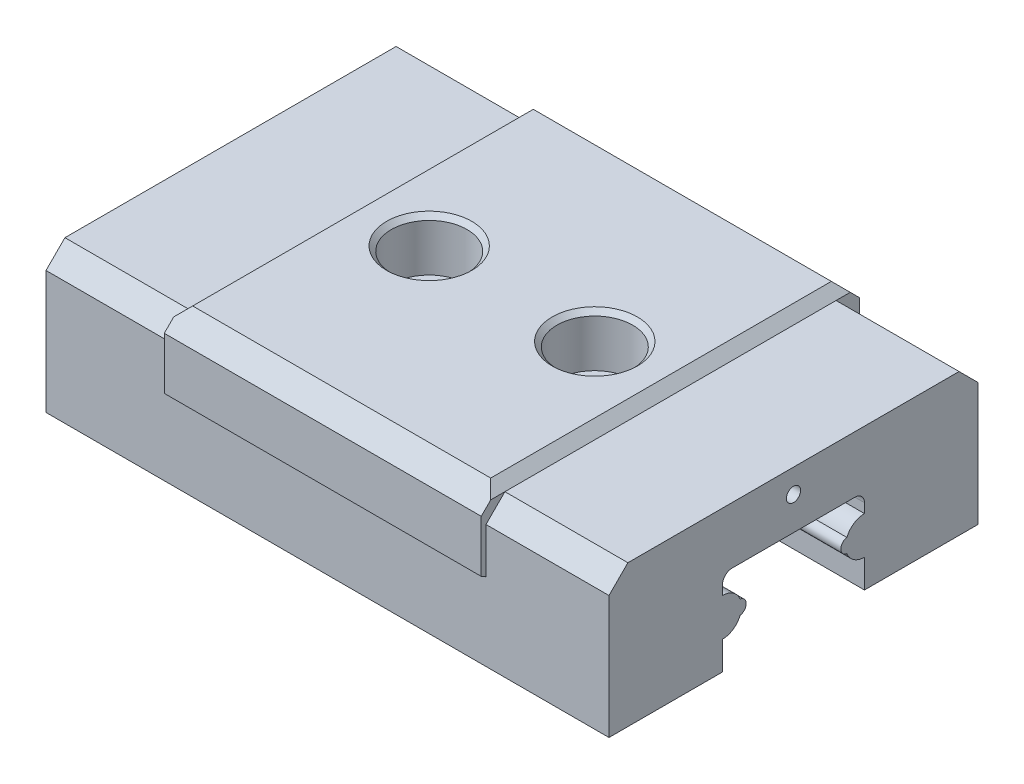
ISO-10303-21;
HEADER;
FILE_DESCRIPTION(('STEP AP214'),'2;1');
FILE_NAME('part.step','',(''),(''),'','','');
FILE_SCHEMA(('AUTOMOTIVE_DESIGN { 1 0 10303 214 1 1 1 1 }'));
ENDSEC;
DATA;
#1=APPLICATION_CONTEXT('core data for automotive mechanical design processes');
#2=APPLICATION_PROTOCOL_DEFINITION('international standard','automotive_design',2000,#1);
#3=PRODUCT_CONTEXT('',#1,'mechanical');
#4=PRODUCT('Part','Part','',(#3));
#5=PRODUCT_RELATED_PRODUCT_CATEGORY('part','',(#4));
#6=PRODUCT_DEFINITION_FORMATION('','',#4);
#7=PRODUCT_DEFINITION_CONTEXT('part definition',#1,'design');
#8=PRODUCT_DEFINITION('design','',#6,#7);
#9=PRODUCT_DEFINITION_SHAPE('','',#8);
#10=(LENGTH_UNIT() NAMED_UNIT(*) SI_UNIT(.MILLI.,.METRE.));
#11=(NAMED_UNIT(*) PLANE_ANGLE_UNIT() SI_UNIT($,.RADIAN.));
#12=(NAMED_UNIT(*) SI_UNIT($,.STERADIAN.) SOLID_ANGLE_UNIT());
#13=UNCERTAINTY_MEASURE_WITH_UNIT(LENGTH_MEASURE(1.E-05),#10,'distance_accuracy_value','');
#14=(GEOMETRIC_REPRESENTATION_CONTEXT(3) GLOBAL_UNCERTAINTY_ASSIGNED_CONTEXT((#13)) GLOBAL_UNIT_ASSIGNED_CONTEXT((#10,
#11,#12)) REPRESENTATION_CONTEXT('',''));
#15=CARTESIAN_POINT('',(0.,0.,0.));
#16=DIRECTION('',(0.,0.,1.));
#17=DIRECTION('',(1.,0.,0.));
#18=AXIS2_PLACEMENT_3D('',#15,#16,#17);
#19=CARTESIAN_POINT('',(0.,0.3,1.5));
#20=DIRECTION('',(0.,0.,1.));
#21=DIRECTION('',(0.,-1.,0.));
#22=AXIS2_PLACEMENT_3D('',#19,#20,#21);
#23=PLANE('',#22);
#24=DIRECTION('',(0.,1.,0.));
#25=VECTOR('',#24,1.);
#26=CARTESIAN_POINT('',(-30.95,0.3,1.5));
#27=LINE('',#26,#25);
#28=CARTESIAN_POINT('',(-30.95,0.8,1.5));
#29=VERTEX_POINT('',#28);
#30=CARTESIAN_POINT('',(-30.95,1.4,1.5));
#31=VERTEX_POINT('',#30);
#32=EDGE_CURVE('E435',#29,#31,#27,.T.);
#33=ORIENTED_EDGE('',*,*,#32,.T.);
#34=DIRECTION('',(1.,0.,0.));
#35=VECTOR('',#34,1.);
#36=CARTESIAN_POINT('',(-30.95,1.4,1.5));
#37=LINE('',#36,#35);
#38=CARTESIAN_POINT('',(-19.05,1.4,1.5));
#39=VERTEX_POINT('',#38);
#40=EDGE_CURVE('E267',#31,#39,#37,.T.);
#41=ORIENTED_EDGE('',*,*,#40,.T.);
#42=DIRECTION('',(0.,-1.,0.));
#43=VECTOR('',#42,1.);
#44=CARTESIAN_POINT('',(-19.05,0.3,1.5));
#45=LINE('',#44,#43);
#46=CARTESIAN_POINT('',(-19.05,0.8,1.5));
#47=VERTEX_POINT('',#46);
#48=EDGE_CURVE('E386',#39,#47,#45,.T.);
#49=ORIENTED_EDGE('',*,*,#48,.T.);
#50=DIRECTION('',(1.,0.,0.));
#51=VECTOR('',#50,1.);
#52=CARTESIAN_POINT('',(-60.,0.8,1.5));
#53=LINE('',#52,#51);
#54=EDGE_CURVE('E474',#29,#47,#53,.T.);
#55=ORIENTED_EDGE('',*,*,#54,.F.);
#56=EDGE_LOOP('',(#33,#41,#49,#55));
#57=FACE_BOUND('',#56,.T.);
#58=ADVANCED_FACE('F39',(#57),#23,.F.);
#59=CARTESIAN_POINT('',(0.,2.6,-1.5));
#60=DIRECTION('',(0.,0.,-1.));
#61=DIRECTION('',(0.,1.,0.));
#62=AXIS2_PLACEMENT_3D('',#59,#60,#61);
#63=PLANE('',#62);
#64=DIRECTION('',(0.,1.,0.));
#65=VECTOR('',#64,1.);
#66=CARTESIAN_POINT('',(-19.05,0.3,-1.5));
#67=LINE('',#66,#65);
#68=CARTESIAN_POINT('',(-19.05,2.2,-1.5));
#69=VERTEX_POINT('',#68);
#70=CARTESIAN_POINT('',(-19.05,2.4,-1.5));
#71=VERTEX_POINT('',#70);
#72=EDGE_CURVE('E383',#69,#71,#67,.T.);
#73=ORIENTED_EDGE('',*,*,#72,.T.);
#74=DIRECTION('',(-1.,0.,0.));
#75=VECTOR('',#74,1.);
#76=CARTESIAN_POINT('',(-30.95,2.4,-1.5));
#77=LINE('',#76,#75);
#78=CARTESIAN_POINT('',(-30.95,2.4,-1.5));
#79=VERTEX_POINT('',#78);
#80=EDGE_CURVE('E543',#71,#79,#77,.T.);
#81=ORIENTED_EDGE('',*,*,#80,.T.);
#82=DIRECTION('',(0.,-1.,0.));
#83=VECTOR('',#82,1.);
#84=CARTESIAN_POINT('',(-30.95,0.3,-1.5));
#85=LINE('',#84,#83);
#86=CARTESIAN_POINT('',(-30.95,2.2,-1.5));
#87=VERTEX_POINT('',#86);
#88=EDGE_CURVE('E504',#79,#87,#85,.T.);
#89=ORIENTED_EDGE('',*,*,#88,.T.);
#90=DIRECTION('',(1.,0.,0.));
#91=VECTOR('',#90,1.);
#92=CARTESIAN_POINT('',(-30.95,2.2,-1.5));
#93=LINE('',#92,#91);
#94=EDGE_CURVE('E537',#87,#69,#93,.T.);
#95=ORIENTED_EDGE('',*,*,#94,.T.);
#96=EDGE_LOOP('',(#73,#81,#89,#95));
#97=FACE_BOUND('',#96,.T.);
#98=ADVANCED_FACE('F565',(#97),#63,.F.);
#99=CARTESIAN_POINT('',(-21.65,4.,-3.9));
#100=DIRECTION('',(-1.,0.,0.));
#101=DIRECTION('',(0.,0.,1.));
#102=AXIS2_PLACEMENT_3D('',#99,#100,#101);
#103=PLANE('',#102);
#104=DIRECTION('',(0.,0.70710678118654,0.707106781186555));
#105=VECTOR('',#104,1.);
#106=CARTESIAN_POINT('',(-21.65,4.,-3.6));
#107=LINE('',#106,#105);
#108=CARTESIAN_POINT('',(-21.65,3.60000000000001,-4.));
#109=VERTEX_POINT('',#108);
#110=CARTESIAN_POINT('',(-21.65,3.8,-3.8));
#111=VERTEX_POINT('',#110);
#112=EDGE_CURVE('E443',#109,#111,#107,.T.);
#113=ORIENTED_EDGE('',*,*,#112,.T.);
#114=DIRECTION('',(0.,0.,1.));
#115=VECTOR('',#114,1.);
#116=CARTESIAN_POINT('',(-21.65,3.8,3.6));
#117=LINE('',#116,#115);
#118=CARTESIAN_POINT('',(-21.65,3.8,-3.5));
#119=VERTEX_POINT('',#118);
#120=EDGE_CURVE('E532',#111,#119,#117,.T.);
#121=ORIENTED_EDGE('',*,*,#120,.T.);
#122=DIRECTION('',(0.,-0.707106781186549,-0.707106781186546));
#123=VECTOR('',#122,1.);
#124=CARTESIAN_POINT('',(-21.65,3.8,-3.5));
#125=LINE('',#124,#123);
#126=CARTESIAN_POINT('',(-21.65,3.4,-3.9));
#127=VERTEX_POINT('',#126);
#128=EDGE_CURVE('E367',#119,#127,#125,.T.);
#129=ORIENTED_EDGE('',*,*,#128,.T.);
#130=DIRECTION('',(0.,-1.,0.));
#131=VECTOR('',#130,1.);
#132=CARTESIAN_POINT('',(-21.65,0.8,-3.9));
#133=LINE('',#132,#131);
#134=CARTESIAN_POINT('',(-21.65,2.44226497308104,-3.9));
#135=VERTEX_POINT('',#134);
#136=EDGE_CURVE('E342',#127,#135,#133,.T.);
#137=ORIENTED_EDGE('',*,*,#136,.T.);
#138=DIRECTION('',(0.,0.500000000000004,-0.866025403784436));
#139=VECTOR('',#138,1.);
#140=CARTESIAN_POINT('',(-21.65,2.5,-4.));
#141=LINE('',#140,#139);
#142=CARTESIAN_POINT('',(-21.65,2.5,-4.));
#143=VERTEX_POINT('',#142);
#144=EDGE_CURVE('E437',#135,#143,#141,.T.);
#145=ORIENTED_EDGE('',*,*,#144,.T.);
#146=DIRECTION('',(0.,1.,0.));
#147=VECTOR('',#146,1.);
#148=CARTESIAN_POINT('',(-21.65,3.60000000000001,-4.));
#149=LINE('',#148,#147);
#150=EDGE_CURVE('E440',#143,#109,#149,.T.);
#151=ORIENTED_EDGE('',*,*,#150,.T.);
#152=EDGE_LOOP('',(#113,#121,#129,#137,#145,#151));
#153=FACE_BOUND('',#152,.T.);
#154=ADVANCED_FACE('F650',(#153),#103,.F.);
#155=CARTESIAN_POINT('',(-28.35,4.,-3.9));
#156=DIRECTION('',(-1.,0.,0.));
#157=DIRECTION('',(0.,0.,1.));
#158=AXIS2_PLACEMENT_3D('',#155,#156,#157);
#159=PLANE('',#158);
#160=DIRECTION('',(0.,-0.70710678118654,0.707106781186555));
#161=VECTOR('',#160,1.);
#162=CARTESIAN_POINT('',(-28.35,4.,3.6));
#163=LINE('',#162,#161);
#164=CARTESIAN_POINT('',(-28.35,3.8,3.80000000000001));
#165=VERTEX_POINT('',#164);
#166=CARTESIAN_POINT('',(-28.35,3.60000000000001,4.));
#167=VERTEX_POINT('',#166);
#168=EDGE_CURVE('E463',#165,#167,#163,.T.);
#169=ORIENTED_EDGE('',*,*,#168,.F.);
#170=DIRECTION('',(0.,0.,-1.));
#171=VECTOR('',#170,1.);
#172=CARTESIAN_POINT('',(-28.35,3.8,-3.9));
#173=LINE('',#172,#171);
#174=CARTESIAN_POINT('',(-28.35,3.8,3.5));
#175=VERTEX_POINT('',#174);
#176=EDGE_CURVE('E524',#165,#175,#173,.T.);
#177=ORIENTED_EDGE('',*,*,#176,.T.);
#178=DIRECTION('',(0.,0.707106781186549,-0.707106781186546));
#179=VECTOR('',#178,1.);
#180=CARTESIAN_POINT('',(-28.35,3.8,3.5));
#181=LINE('',#180,#179);
#182=CARTESIAN_POINT('',(-28.35,3.4,3.9));
#183=VERTEX_POINT('',#182);
#184=EDGE_CURVE('E414',#183,#175,#181,.T.);
#185=ORIENTED_EDGE('',*,*,#184,.F.);
#186=DIRECTION('',(0.,-1.,0.));
#187=VECTOR('',#186,1.);
#188=CARTESIAN_POINT('',(-28.35,4.,3.9));
#189=LINE('',#188,#187);
#190=CARTESIAN_POINT('',(-28.35,2.44226497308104,3.9));
#191=VERTEX_POINT('',#190);
#192=EDGE_CURVE('E501',#183,#191,#189,.T.);
#193=ORIENTED_EDGE('',*,*,#192,.T.);
#194=DIRECTION('',(0.,-0.500000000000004,-0.866025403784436));
#195=VECTOR('',#194,1.);
#196=CARTESIAN_POINT('',(-28.35,2.5,4.));
#197=LINE('',#196,#195);
#198=CARTESIAN_POINT('',(-28.35,2.5,4.));
#199=VERTEX_POINT('',#198);
#200=EDGE_CURVE('E468',#199,#191,#197,.T.);
#201=ORIENTED_EDGE('',*,*,#200,.F.);
#202=DIRECTION('',(0.,-1.,0.));
#203=VECTOR('',#202,1.);
#204=CARTESIAN_POINT('',(-28.35,3.60000000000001,4.));
#205=LINE('',#204,#203);
#206=EDGE_CURVE('E465',#167,#199,#205,.T.);
#207=ORIENTED_EDGE('',*,*,#206,.F.);
#208=EDGE_LOOP('',(#169,#177,#185,#193,#201,#207));
#209=FACE_BOUND('',#208,.T.);
#210=ADVANCED_FACE('F724',(#209),#159,.T.);
#211=CARTESIAN_POINT('',(-19.05,3.8,-3.9));
#212=DIRECTION('',(-1.,0.,0.));
#213=DIRECTION('',(0.,0.,-1.));
#214=AXIS2_PLACEMENT_3D('',#211,#212,#213);
#215=PLANE('',#214);
#216=ORIENTED_EDGE('',*,*,#48,.F.);
#217=CARTESIAN_POINT('',(-19.05,1.8,1.5));
#218=DIRECTION('',(1.,0.,0.));
#219=DIRECTION('',(0.,0.,1.));
#220=AXIS2_PLACEMENT_3D('',#217,#218,#219);
#221=CIRCLE('',#220,0.4);
#222=CARTESIAN_POINT('',(-19.05,1.65153850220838,1.12857142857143));
#223=VERTEX_POINT('',#222);
#224=EDGE_CURVE('E288',#39,#223,#221,.T.);
#225=ORIENTED_EDGE('',*,*,#224,.T.);
#226=CARTESIAN_POINT('',(-19.05,1.8,1.15));
#227=DIRECTION('',(1.,0.,0.));
#228=DIRECTION('',(0.,0.,1.));
#229=AXIS2_PLACEMENT_3D('',#226,#227,#228);
#230=CIRCLE('',#229,0.150000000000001);
#231=CARTESIAN_POINT('',(-19.05,1.94846149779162,1.12857142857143));
#232=VERTEX_POINT('',#231);
#233=EDGE_CURVE('E271',#223,#232,#230,.T.);
#234=ORIENTED_EDGE('',*,*,#233,.T.);
#235=CARTESIAN_POINT('',(-19.05,2.2,1.5));
#236=VERTEX_POINT('',#235);
#237=EDGE_CURVE('E285',#232,#236,#221,.T.);
#238=ORIENTED_EDGE('',*,*,#237,.T.);
#239=CARTESIAN_POINT('',(-19.05,2.4,1.5));
#240=VERTEX_POINT('',#239);
#241=EDGE_CURVE('E387',#240,#236,#45,.T.);
#242=ORIENTED_EDGE('',*,*,#241,.F.);
#243=CARTESIAN_POINT('',(-19.05,2.4,1.3));
#244=DIRECTION('',(-1.,0.,0.));
#245=DIRECTION('',(0.,0.,1.));
#246=AXIS2_PLACEMENT_3D('',#243,#244,#245);
#247=CIRCLE('',#246,0.2);
#248=CARTESIAN_POINT('',(-19.05,2.6,1.3));
#249=VERTEX_POINT('',#248);
#250=EDGE_CURVE('E11',#240,#249,#247,.T.);
#251=ORIENTED_EDGE('',*,*,#250,.T.);
#252=DIRECTION('',(0.,0.,1.));
#253=VECTOR('',#252,1.);
#254=CARTESIAN_POINT('',(-19.05,2.6,-1.5));
#255=LINE('',#254,#253);
#256=CARTESIAN_POINT('',(-19.05,2.6,-1.3));
#257=VERTEX_POINT('',#256);
#258=EDGE_CURVE('E508',#257,#249,#255,.T.);
#259=ORIENTED_EDGE('',*,*,#258,.F.);
#260=CARTESIAN_POINT('',(-19.05,2.4,-1.3));
#261=DIRECTION('',(-1.,0.,0.));
#262=DIRECTION('',(0.,0.,1.));
#263=AXIS2_PLACEMENT_3D('',#260,#261,#262);
#264=CIRCLE('',#263,0.2);
#265=EDGE_CURVE('E554',#257,#71,#264,.T.);
#266=ORIENTED_EDGE('',*,*,#265,.T.);
#267=ORIENTED_EDGE('',*,*,#72,.F.);
#268=CARTESIAN_POINT('',(-19.05,1.8,-1.5));
#269=DIRECTION('',(1.,0.,0.));
#270=DIRECTION('',(0.,0.,-1.));
#271=AXIS2_PLACEMENT_3D('',#268,#269,#270);
#272=CIRCLE('',#271,0.4);
#273=CARTESIAN_POINT('',(-19.05,1.94846149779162,-1.12857142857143));
#274=VERTEX_POINT('',#273);
#275=EDGE_CURVE('E303',#69,#274,#272,.T.);
#276=ORIENTED_EDGE('',*,*,#275,.T.);
#277=CARTESIAN_POINT('',(-19.05,1.8,-1.15));
#278=DIRECTION('',(1.,0.,0.));
#279=DIRECTION('',(0.,0.,-1.));
#280=AXIS2_PLACEMENT_3D('',#277,#278,#279);
#281=CIRCLE('',#280,0.150000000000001);
#282=CARTESIAN_POINT('',(-19.05,1.65153850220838,-1.12857142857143));
#283=VERTEX_POINT('',#282);
#284=EDGE_CURVE('E290',#274,#283,#281,.T.);
#285=ORIENTED_EDGE('',*,*,#284,.T.);
#286=CARTESIAN_POINT('',(-19.05,1.4,-1.5));
#287=VERTEX_POINT('',#286);
#288=EDGE_CURVE('E296',#283,#287,#272,.T.);
#289=ORIENTED_EDGE('',*,*,#288,.T.);
#290=CARTESIAN_POINT('',(-19.05,0.8,-1.5));
#291=VERTEX_POINT('',#290);
#292=EDGE_CURVE('E384',#291,#287,#67,.T.);
#293=ORIENTED_EDGE('',*,*,#292,.F.);
#294=DIRECTION('',(0.,0.,1.));
#295=VECTOR('',#294,1.);
#296=CARTESIAN_POINT('',(-19.05,0.8,-3.9));
#297=LINE('',#296,#295);
#298=CARTESIAN_POINT('',(-19.05,0.8,-3.9));
#299=VERTEX_POINT('',#298);
#300=EDGE_CURVE('E362',#299,#291,#297,.T.);
#301=ORIENTED_EDGE('',*,*,#300,.F.);
#302=DIRECTION('',(0.,-1.,0.));
#303=VECTOR('',#302,1.);
#304=CARTESIAN_POINT('',(-19.05,0.8,-3.9));
#305=LINE('',#304,#303);
#306=CARTESIAN_POINT('',(-19.05,3.4,-3.9));
#307=VERTEX_POINT('',#306);
#308=EDGE_CURVE('E345',#307,#299,#305,.T.);
#309=ORIENTED_EDGE('',*,*,#308,.F.);
#310=DIRECTION('',(0.,-0.707106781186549,-0.707106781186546));
#311=VECTOR('',#310,1.);
#312=CARTESIAN_POINT('',(-19.05,3.8,-3.5));
#313=LINE('',#312,#311);
#314=CARTESIAN_POINT('',(-19.05,3.8,-3.5));
#315=VERTEX_POINT('',#314);
#316=EDGE_CURVE('E348',#315,#307,#313,.T.);
#317=ORIENTED_EDGE('',*,*,#316,.F.);
#318=DIRECTION('',(0.,0.,-1.));
#319=VECTOR('',#318,1.);
#320=CARTESIAN_POINT('',(-19.05,3.8,-3.5));
#321=LINE('',#320,#319);
#322=CARTESIAN_POINT('',(-19.05,3.8,3.5));
#323=VERTEX_POINT('',#322);
#324=EDGE_CURVE('E352',#323,#315,#321,.T.);
#325=ORIENTED_EDGE('',*,*,#324,.F.);
#326=DIRECTION('',(0.,0.707106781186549,-0.707106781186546));
#327=VECTOR('',#326,1.);
#328=CARTESIAN_POINT('',(-19.05,3.8,3.5));
#329=LINE('',#328,#327);
#330=CARTESIAN_POINT('',(-19.05,3.4,3.9));
#331=VERTEX_POINT('',#330);
#332=EDGE_CURVE('E355',#331,#323,#329,.T.);
#333=ORIENTED_EDGE('',*,*,#332,.F.);
#334=DIRECTION('',(0.,1.,0.));
#335=VECTOR('',#334,1.);
#336=CARTESIAN_POINT('',(-19.05,0.8,3.9));
#337=LINE('',#336,#335);
#338=CARTESIAN_POINT('',(-19.05,0.8,3.9));
#339=VERTEX_POINT('',#338);
#340=EDGE_CURVE('E358',#339,#331,#337,.T.);
#341=ORIENTED_EDGE('',*,*,#340,.F.);
#342=EDGE_CURVE('E361',#47,#339,#297,.T.);
#343=ORIENTED_EDGE('',*,*,#342,.F.);
#344=EDGE_LOOP('',(#216,#225,#234,#238,#242,#251,#259,#266,#267,#276,#285,#289,#293,#301,#309,
#317,#325,#333,#341,#343));
#345=FACE_BOUND('',#344,.T.);
#346=CARTESIAN_POINT('',(-19.05,3.3,0.));
#347=DIRECTION('',(-1.,0.,0.));
#348=DIRECTION('',(0.,0.,1.));
#349=AXIS2_PLACEMENT_3D('',#346,#347,#348);
#350=CIRCLE('',#349,0.15);
#351=CARTESIAN_POINT('',(-19.05,3.3,0.15));
#352=VERTEX_POINT('',#351);
#353=EDGE_CURVE('E338',#352,#352,#350,.T.);
#354=ORIENTED_EDGE('',*,*,#353,.T.);
#355=EDGE_LOOP('',(#354));
#356=FACE_BOUND('',#355,.T.);
#357=ADVANCED_FACE('F559',(#345,#356),#215,.F.);
#358=DIRECTION('',(0.,-0.707106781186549,-0.707106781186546));
#359=VECTOR('',#358,1.);
#360=CARTESIAN_POINT('',(-28.35,3.8,-3.5));
#361=LINE('',#360,#359);
#362=CARTESIAN_POINT('',(-28.35,3.8,-3.5));
#363=VERTEX_POINT('',#362);
#364=CARTESIAN_POINT('',(-28.35,3.4,-3.9));
#365=VERTEX_POINT('',#364);
#366=EDGE_CURVE('E400',#363,#365,#361,.T.);
#367=ORIENTED_EDGE('',*,*,#366,.F.);
#368=DIRECTION('',(0.,0.,-1.));
#369=VECTOR('',#368,1.);
#370=CARTESIAN_POINT('',(-28.35,3.8,-3.9));
#371=LINE('',#370,#369);
#372=CARTESIAN_POINT('',(-28.35,3.8,-3.80000000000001));
#373=VERTEX_POINT('',#372);
#374=EDGE_CURVE('E522',#363,#373,#371,.T.);
#375=ORIENTED_EDGE('',*,*,#374,.T.);
#376=DIRECTION('',(0.,0.70710678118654,0.707106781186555));
#377=VECTOR('',#376,1.);
#378=CARTESIAN_POINT('',(-28.35,4.,-3.6));
#379=LINE('',#378,#377);
#380=CARTESIAN_POINT('',(-28.35,3.60000000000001,-4.));
#381=VERTEX_POINT('',#380);
#382=EDGE_CURVE('E460',#381,#373,#379,.T.);
#383=ORIENTED_EDGE('',*,*,#382,.F.);
#384=DIRECTION('',(0.,1.,0.));
#385=VECTOR('',#384,1.);
#386=CARTESIAN_POINT('',(-28.35,3.60000000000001,-4.));
#387=LINE('',#386,#385);
#388=CARTESIAN_POINT('',(-28.35,2.5,-4.));
#389=VERTEX_POINT('',#388);
#390=EDGE_CURVE('E457',#389,#381,#387,.T.);
#391=ORIENTED_EDGE('',*,*,#390,.F.);
#392=DIRECTION('',(0.,0.500000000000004,-0.866025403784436));
#393=VECTOR('',#392,1.);
#394=CARTESIAN_POINT('',(-28.35,2.5,-4.));
#395=LINE('',#394,#393);
#396=CARTESIAN_POINT('',(-28.35,2.44226497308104,-3.9));
#397=VERTEX_POINT('',#396);
#398=EDGE_CURVE('E454',#397,#389,#395,.T.);
#399=ORIENTED_EDGE('',*,*,#398,.F.);
#400=DIRECTION('',(0.,-1.,0.));
#401=VECTOR('',#400,1.);
#402=CARTESIAN_POINT('',(-28.35,0.8,-3.9));
#403=LINE('',#402,#401);
#404=EDGE_CURVE('E393',#365,#397,#403,.T.);
#405=ORIENTED_EDGE('',*,*,#404,.F.);
#406=EDGE_LOOP('',(#367,#375,#383,#391,#399,#405));
#407=FACE_BOUND('',#406,.T.);
#408=ADVANCED_FACE('F720',(#407),#159,.T.);
#409=CARTESIAN_POINT('',(-28.35,0.8,3.9));
#410=DIRECTION('',(0.,-1.,0.));
#411=DIRECTION('',(0.,0.,-1.));
#412=AXIS2_PLACEMENT_3D('',#409,#410,#411);
#413=PLANE('',#412);
#414=DIRECTION('',(1.,0.,0.));
#415=VECTOR('',#414,1.);
#416=CARTESIAN_POINT('',(-28.35,0.8,3.9));
#417=LINE('',#416,#415);
#418=CARTESIAN_POINT('',(-30.95,0.8,3.9));
#419=VERTEX_POINT('',#418);
#420=EDGE_CURVE('E475',#419,#339,#417,.T.);
#421=ORIENTED_EDGE('',*,*,#420,.F.);
#422=DIRECTION('',(0.,0.,1.));
#423=VECTOR('',#422,1.);
#424=CARTESIAN_POINT('',(-30.95,0.8,-3.9));
#425=LINE('',#424,#423);
#426=EDGE_CURVE('E399',#29,#419,#425,.T.);
#427=ORIENTED_EDGE('',*,*,#426,.F.);
#428=ORIENTED_EDGE('',*,*,#54,.T.);
#429=ORIENTED_EDGE('',*,*,#342,.T.);
#430=EDGE_LOOP('',(#421,#427,#428,#429));
#431=FACE_BOUND('',#430,.T.);
#432=ADVANCED_FACE('F589',(#431),#413,.T.);
#433=CARTESIAN_POINT('',(-28.35,0.8,-3.9));
#434=DIRECTION('',(0.,0.,-1.));
#435=DIRECTION('',(0.,1.,0.));
#436=AXIS2_PLACEMENT_3D('',#433,#434,#435);
#437=PLANE('',#436);
#438=DIRECTION('',(1.,0.,0.));
#439=VECTOR('',#438,1.);
#440=CARTESIAN_POINT('',(-28.35,2.44226497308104,-3.9));
#441=LINE('',#440,#439);
#442=EDGE_CURVE('E471',#397,#135,#441,.T.);
#443=ORIENTED_EDGE('',*,*,#442,.T.);
#444=ORIENTED_EDGE('',*,*,#136,.F.);
#445=DIRECTION('',(-1.,0.,0.));
#446=VECTOR('',#445,1.);
#447=CARTESIAN_POINT('',(-19.05,3.4,-3.9));
#448=LINE('',#447,#446);
#449=EDGE_CURVE('E380',#307,#127,#448,.T.);
#450=ORIENTED_EDGE('',*,*,#449,.F.);
#451=ORIENTED_EDGE('',*,*,#308,.T.);
#452=DIRECTION('',(1.,0.,0.));
#453=VECTOR('',#452,1.);
#454=CARTESIAN_POINT('',(-28.35,0.8,-3.9));
#455=LINE('',#454,#453);
#456=CARTESIAN_POINT('',(-30.95,0.8,-3.9));
#457=VERTEX_POINT('',#456);
#458=EDGE_CURVE('E472',#457,#299,#455,.T.);
#459=ORIENTED_EDGE('',*,*,#458,.F.);
#460=DIRECTION('',(0.,-1.,0.));
#461=VECTOR('',#460,1.);
#462=CARTESIAN_POINT('',(-30.95,0.8,-3.9));
#463=LINE('',#462,#461);
#464=CARTESIAN_POINT('',(-30.95,3.4,-3.9));
#465=VERTEX_POINT('',#464);
#466=EDGE_CURVE('E396',#465,#457,#463,.T.);
#467=ORIENTED_EDGE('',*,*,#466,.F.);
#468=DIRECTION('',(1.,0.,0.));
#469=VECTOR('',#468,1.);
#470=CARTESIAN_POINT('',(-30.95,3.4,-3.9));
#471=LINE('',#470,#469);
#472=EDGE_CURVE('E412',#465,#365,#471,.T.);
#473=ORIENTED_EDGE('',*,*,#472,.T.);
#474=ORIENTED_EDGE('',*,*,#404,.T.);
#475=EDGE_LOOP('',(#443,#444,#450,#451,#459,#467,#473,#474));
#476=FACE_BOUND('',#475,.T.);
#477=ADVANCED_FACE('F612',(#476),#437,.T.);
#478=ORIENTED_EDGE('',*,*,#458,.T.);
#479=ORIENTED_EDGE('',*,*,#300,.T.);
#480=DIRECTION('',(-1.,0.,0.));
#481=VECTOR('',#480,1.);
#482=CARTESIAN_POINT('',(-60.,0.8,-1.5));
#483=LINE('',#482,#481);
#484=CARTESIAN_POINT('',(-30.95,0.8,-1.5));
#485=VERTEX_POINT('',#484);
#486=EDGE_CURVE('E498',#291,#485,#483,.T.);
#487=ORIENTED_EDGE('',*,*,#486,.T.);
#488=EDGE_CURVE('E401',#457,#485,#425,.T.);
#489=ORIENTED_EDGE('',*,*,#488,.F.);
#490=EDGE_LOOP('',(#478,#479,#487,#489));
#491=FACE_BOUND('',#490,.T.);
#492=ADVANCED_FACE('F617',(#491),#413,.T.);
#493=CARTESIAN_POINT('',(-28.35,0.8,3.9));
#494=DIRECTION('',(0.,0.,1.));
#495=DIRECTION('',(0.,-1.,0.));
#496=AXIS2_PLACEMENT_3D('',#493,#494,#495);
#497=PLANE('',#496);
#498=ORIENTED_EDGE('',*,*,#420,.T.);
#499=ORIENTED_EDGE('',*,*,#340,.T.);
#500=DIRECTION('',(-1.,0.,0.));
#501=VECTOR('',#500,1.);
#502=CARTESIAN_POINT('',(-19.05,3.4,3.9));
#503=LINE('',#502,#501);
#504=CARTESIAN_POINT('',(-21.65,3.4,3.9));
#505=VERTEX_POINT('',#504);
#506=EDGE_CURVE('E365',#331,#505,#503,.T.);
#507=ORIENTED_EDGE('',*,*,#506,.T.);
#508=DIRECTION('',(0.,1.,0.));
#509=VECTOR('',#508,1.);
#510=CARTESIAN_POINT('',(-21.65,4.,3.9));
#511=LINE('',#510,#509);
#512=CARTESIAN_POINT('',(-21.65,2.44226497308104,3.9));
#513=VERTEX_POINT('',#512);
#514=EDGE_CURVE('E506',#513,#505,#511,.T.);
#515=ORIENTED_EDGE('',*,*,#514,.F.);
#516=DIRECTION('',(1.,0.,0.));
#517=VECTOR('',#516,1.);
#518=CARTESIAN_POINT('',(-28.35,2.44226497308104,3.9));
#519=LINE('',#518,#517);
#520=EDGE_CURVE('E477',#191,#513,#519,.T.);
#521=ORIENTED_EDGE('',*,*,#520,.F.);
#522=ORIENTED_EDGE('',*,*,#192,.F.);
#523=DIRECTION('',(1.,0.,0.));
#524=VECTOR('',#523,1.);
#525=CARTESIAN_POINT('',(-30.95,3.4,3.9));
#526=LINE('',#525,#524);
#527=CARTESIAN_POINT('',(-30.95,3.4,3.9));
#528=VERTEX_POINT('',#527);
#529=EDGE_CURVE('E428',#528,#183,#526,.T.);
#530=ORIENTED_EDGE('',*,*,#529,.F.);
#531=DIRECTION('',(0.,1.,0.));
#532=VECTOR('',#531,1.);
#533=CARTESIAN_POINT('',(-30.95,0.8,3.9));
#534=LINE('',#533,#532);
#535=EDGE_CURVE('E404',#419,#528,#534,.T.);
#536=ORIENTED_EDGE('',*,*,#535,.F.);
#537=EDGE_LOOP('',(#498,#499,#507,#515,#521,#522,#530,#536));
#538=FACE_BOUND('',#537,.T.);
#539=ADVANCED_FACE('F591',(#538),#497,.T.);
#540=CARTESIAN_POINT('',(-28.35,2.5,4.));
#541=DIRECTION('',(0.,-0.866025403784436,0.500000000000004));
#542=DIRECTION('',(0.,-0.500000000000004,-0.866025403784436));
#543=AXIS2_PLACEMENT_3D('',#540,#541,#542);
#544=PLANE('',#543);
#545=ORIENTED_EDGE('',*,*,#520,.T.);
#546=DIRECTION('',(0.,-0.500000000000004,-0.866025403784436));
#547=VECTOR('',#546,1.);
#548=CARTESIAN_POINT('',(-21.65,2.5,4.));
#549=LINE('',#548,#547);
#550=CARTESIAN_POINT('',(-21.65,2.5,4.));
#551=VERTEX_POINT('',#550);
#552=EDGE_CURVE('E451',#551,#513,#549,.T.);
#553=ORIENTED_EDGE('',*,*,#552,.F.);
#554=DIRECTION('',(1.,0.,0.));
#555=VECTOR('',#554,1.);
#556=CARTESIAN_POINT('',(-28.35,2.5,4.));
#557=LINE('',#556,#555);
#558=EDGE_CURVE('E479',#199,#551,#557,.T.);
#559=ORIENTED_EDGE('',*,*,#558,.F.);
#560=ORIENTED_EDGE('',*,*,#200,.T.);
#561=EDGE_LOOP('',(#545,#553,#559,#560));
#562=FACE_BOUND('',#561,.T.);
#563=ADVANCED_FACE('F711',(#562),#544,.T.);
#564=CARTESIAN_POINT('',(-28.35,3.60000000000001,4.));
#565=DIRECTION('',(0.,0.,1.));
#566=DIRECTION('',(0.,-1.,0.));
#567=AXIS2_PLACEMENT_3D('',#564,#565,#566);
#568=PLANE('',#567);
#569=ORIENTED_EDGE('',*,*,#558,.T.);
#570=DIRECTION('',(0.,-1.,0.));
#571=VECTOR('',#570,1.);
#572=CARTESIAN_POINT('',(-21.65,3.60000000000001,4.));
#573=LINE('',#572,#571);
#574=CARTESIAN_POINT('',(-21.65,3.60000000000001,4.));
#575=VERTEX_POINT('',#574);
#576=EDGE_CURVE('E448',#575,#551,#573,.T.);
#577=ORIENTED_EDGE('',*,*,#576,.F.);
#578=DIRECTION('',(1.,0.,0.));
#579=VECTOR('',#578,1.);
#580=CARTESIAN_POINT('',(-28.35,3.60000000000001,4.));
#581=LINE('',#580,#579);
#582=EDGE_CURVE('E481',#167,#575,#581,.T.);
#583=ORIENTED_EDGE('',*,*,#582,.F.);
#584=ORIENTED_EDGE('',*,*,#206,.T.);
#585=EDGE_LOOP('',(#569,#577,#583,#584));
#586=FACE_BOUND('',#585,.T.);
#587=ADVANCED_FACE('F707',(#586),#568,.T.);
#588=CARTESIAN_POINT('',(-28.35,4.,3.6));
#589=DIRECTION('',(0.,0.707106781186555,0.70710678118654));
#590=DIRECTION('',(0.,-0.70710678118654,0.707106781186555));
#591=AXIS2_PLACEMENT_3D('',#588,#589,#590);
#592=PLANE('',#591);
#593=DIRECTION('',(1.,0.,0.));
#594=VECTOR('',#593,1.);
#595=CARTESIAN_POINT('',(-28.35,4.,3.6));
#596=LINE('',#595,#594);
#597=CARTESIAN_POINT('',(-28.15,4.,3.6));
#598=VERTEX_POINT('',#597);
#599=CARTESIAN_POINT('',(-21.85,4.,3.6));
#600=VERTEX_POINT('',#599);
#601=EDGE_CURVE('E484',#598,#600,#596,.T.);
#602=ORIENTED_EDGE('',*,*,#601,.F.);
#603=DIRECTION('',(0.577350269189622,0.577350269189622,-0.577350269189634));
#604=VECTOR('',#603,1.);
#605=CARTESIAN_POINT('',(-28.2166666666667,3.93333333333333,3.66666666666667));
#606=LINE('',#605,#604);
#607=EDGE_CURVE('E520',#598,#165,#606,.F.);
#608=ORIENTED_EDGE('',*,*,#607,.T.);
#609=ORIENTED_EDGE('',*,*,#168,.T.);
#610=ORIENTED_EDGE('',*,*,#582,.T.);
#611=DIRECTION('',(0.,-0.70710678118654,0.707106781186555));
#612=VECTOR('',#611,1.);
#613=CARTESIAN_POINT('',(-21.65,4.,3.6));
#614=LINE('',#613,#612);
#615=CARTESIAN_POINT('',(-21.65,3.8,3.8));
#616=VERTEX_POINT('',#615);
#617=EDGE_CURVE('E446',#616,#575,#614,.T.);
#618=ORIENTED_EDGE('',*,*,#617,.F.);
#619=DIRECTION('',(-0.577350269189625,0.57735026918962,-0.577350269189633));
#620=VECTOR('',#619,1.);
#621=CARTESIAN_POINT('',(-24.0166666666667,6.16666666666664,1.43333333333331));
#622=LINE('',#621,#620);
#623=EDGE_CURVE('E518',#616,#600,#622,.T.);
#624=ORIENTED_EDGE('',*,*,#623,.T.);
#625=EDGE_LOOP('',(#602,#608,#609,#610,#618,#624));
#626=FACE_BOUND('',#625,.T.);
#627=ADVANCED_FACE('F703',(#626),#592,.T.);
#628=CARTESIAN_POINT('',(-28.35,4.,3.6));
#629=DIRECTION('',(0.,1.,0.));
#630=DIRECTION('',(0.,0.,1.));
#631=AXIS2_PLACEMENT_3D('',#628,#629,#630);
#632=PLANE('',#631);
#633=CARTESIAN_POINT('',(-23.25,4.,0.));
#634=DIRECTION('',(0.,1.,0.));
#635=DIRECTION('',(0.,0.,1.));
#636=AXIS2_PLACEMENT_3D('',#633,#634,#635);
#637=CIRCLE('',#636,0.900000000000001);
#638=CARTESIAN_POINT('',(-23.25,4.,0.900000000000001));
#639=VERTEX_POINT('',#638);
#640=EDGE_CURVE('E323',#639,#639,#637,.T.);
#641=ORIENTED_EDGE('',*,*,#640,.F.);
#642=EDGE_LOOP('',(#641));
#643=FACE_BOUND('',#642,.T.);
#644=CARTESIAN_POINT('',(-26.75,4.,0.));
#645=DIRECTION('',(0.,1.,0.));
#646=DIRECTION('',(0.,0.,1.));
#647=AXIS2_PLACEMENT_3D('',#644,#645,#646);
#648=CIRCLE('',#647,0.900000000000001);
#649=CARTESIAN_POINT('',(-26.75,4.,0.900000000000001));
#650=VERTEX_POINT('',#649);
#651=EDGE_CURVE('E335',#650,#650,#648,.T.);
#652=ORIENTED_EDGE('',*,*,#651,.F.);
#653=EDGE_LOOP('',(#652));
#654=FACE_BOUND('',#653,.T.);
#655=DIRECTION('',(1.,0.,0.));
#656=VECTOR('',#655,1.);
#657=CARTESIAN_POINT('',(-28.35,4.,-3.6));
#658=LINE('',#657,#656);
#659=CARTESIAN_POINT('',(-28.15,4.,-3.6));
#660=VERTEX_POINT('',#659);
#661=CARTESIAN_POINT('',(-21.85,4.,-3.6));
#662=VERTEX_POINT('',#661);
#663=EDGE_CURVE('E487',#660,#662,#658,.T.);
#664=ORIENTED_EDGE('',*,*,#663,.F.);
#665=DIRECTION('',(0.,0.,1.));
#666=VECTOR('',#665,1.);
#667=CARTESIAN_POINT('',(-28.15,4.,3.6));
#668=LINE('',#667,#666);
#669=EDGE_CURVE('E515',#660,#598,#668,.T.);
#670=ORIENTED_EDGE('',*,*,#669,.T.);
#671=ORIENTED_EDGE('',*,*,#601,.T.);
#672=DIRECTION('',(0.,0.,-1.));
#673=VECTOR('',#672,1.);
#674=CARTESIAN_POINT('',(-21.85,4.,-3.6));
#675=LINE('',#674,#673);
#676=EDGE_CURVE('E511',#600,#662,#675,.T.);
#677=ORIENTED_EDGE('',*,*,#676,.T.);
#678=EDGE_LOOP('',(#664,#670,#671,#677));
#679=FACE_BOUND('',#678,.T.);
#680=ADVANCED_FACE('F699',(#643,#654,#679),#632,.T.);
#681=CARTESIAN_POINT('',(-28.35,4.,-3.6));
#682=DIRECTION('',(0.,0.707106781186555,-0.70710678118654));
#683=DIRECTION('',(0.,0.70710678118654,0.707106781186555));
#684=AXIS2_PLACEMENT_3D('',#681,#682,#683);
#685=PLANE('',#684);
#686=ORIENTED_EDGE('',*,*,#382,.T.);
#687=DIRECTION('',(-0.577350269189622,-0.577350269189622,-0.577350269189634));
#688=VECTOR('',#687,1.);
#689=CARTESIAN_POINT('',(-28.2166666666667,3.93333333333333,-3.66666666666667));
#690=LINE('',#689,#688);
#691=EDGE_CURVE('E528',#373,#660,#690,.F.);
#692=ORIENTED_EDGE('',*,*,#691,.T.);
#693=ORIENTED_EDGE('',*,*,#663,.T.);
#694=DIRECTION('',(0.577350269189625,-0.57735026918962,-0.577350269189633));
#695=VECTOR('',#694,1.);
#696=CARTESIAN_POINT('',(-24.0166666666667,6.16666666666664,-1.43333333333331));
#697=LINE('',#696,#695);
#698=EDGE_CURVE('E526',#662,#111,#697,.T.);
#699=ORIENTED_EDGE('',*,*,#698,.T.);
#700=ORIENTED_EDGE('',*,*,#112,.F.);
#701=DIRECTION('',(1.,0.,0.));
#702=VECTOR('',#701,1.);
#703=CARTESIAN_POINT('',(-28.35,3.60000000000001,-4.));
#704=LINE('',#703,#702);
#705=EDGE_CURVE('E490',#381,#109,#704,.T.);
#706=ORIENTED_EDGE('',*,*,#705,.F.);
#707=EDGE_LOOP('',(#686,#692,#693,#699,#700,#706));
#708=FACE_BOUND('',#707,.T.);
#709=ADVANCED_FACE('F695',(#708),#685,.T.);
#710=CARTESIAN_POINT('',(-28.35,3.60000000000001,-4.));
#711=DIRECTION('',(0.,0.,-1.));
#712=DIRECTION('',(0.,1.,0.));
#713=AXIS2_PLACEMENT_3D('',#710,#711,#712);
#714=PLANE('',#713);
#715=ORIENTED_EDGE('',*,*,#705,.T.);
#716=ORIENTED_EDGE('',*,*,#150,.F.);
#717=DIRECTION('',(1.,0.,0.));
#718=VECTOR('',#717,1.);
#719=CARTESIAN_POINT('',(-28.35,2.5,-4.));
#720=LINE('',#719,#718);
#721=EDGE_CURVE('E492',#389,#143,#720,.T.);
#722=ORIENTED_EDGE('',*,*,#721,.F.);
#723=ORIENTED_EDGE('',*,*,#390,.T.);
#724=EDGE_LOOP('',(#715,#716,#722,#723));
#725=FACE_BOUND('',#724,.T.);
#726=ADVANCED_FACE('F691',(#725),#714,.T.);
#727=CARTESIAN_POINT('',(-28.35,2.5,-4.));
#728=DIRECTION('',(0.,-0.866025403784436,-0.500000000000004));
#729=DIRECTION('',(0.,0.500000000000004,-0.866025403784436));
#730=AXIS2_PLACEMENT_3D('',#727,#728,#729);
#731=PLANE('',#730);
#732=ORIENTED_EDGE('',*,*,#721,.T.);
#733=ORIENTED_EDGE('',*,*,#144,.F.);
#734=ORIENTED_EDGE('',*,*,#442,.F.);
#735=ORIENTED_EDGE('',*,*,#398,.T.);
#736=EDGE_LOOP('',(#732,#733,#734,#735));
#737=FACE_BOUND('',#736,.T.);
#738=ADVANCED_FACE('F687',(#737),#731,.T.);
#739=DIRECTION('',(0.,0.707106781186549,-0.707106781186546));
#740=VECTOR('',#739,1.);
#741=CARTESIAN_POINT('',(-21.65,3.8,3.5));
#742=LINE('',#741,#740);
#743=CARTESIAN_POINT('',(-21.65,3.8,3.5));
#744=VERTEX_POINT('',#743);
#745=EDGE_CURVE('E349',#505,#744,#742,.T.);
#746=ORIENTED_EDGE('',*,*,#745,.T.);
#747=DIRECTION('',(0.,0.,1.));
#748=VECTOR('',#747,1.);
#749=CARTESIAN_POINT('',(-21.65,3.8,3.6));
#750=LINE('',#749,#748);
#751=EDGE_CURVE('E530',#744,#616,#750,.T.);
#752=ORIENTED_EDGE('',*,*,#751,.T.);
#753=ORIENTED_EDGE('',*,*,#617,.T.);
#754=ORIENTED_EDGE('',*,*,#576,.T.);
#755=ORIENTED_EDGE('',*,*,#552,.T.);
#756=ORIENTED_EDGE('',*,*,#514,.T.);
#757=EDGE_LOOP('',(#746,#752,#753,#754,#755,#756));
#758=FACE_BOUND('',#757,.T.);
#759=ADVANCED_FACE('F690',(#758),#103,.F.);
#760=CARTESIAN_POINT('',(-30.95,3.8,3.5));
#761=DIRECTION('',(0.,-0.707106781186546,-0.707106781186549));
#762=DIRECTION('',(0.,0.707106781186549,-0.707106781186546));
#763=AXIS2_PLACEMENT_3D('',#760,#761,#762);
#764=PLANE('',#763);
#765=ORIENTED_EDGE('',*,*,#184,.T.);
#766=DIRECTION('',(1.,0.,0.));
#767=VECTOR('',#766,1.);
#768=CARTESIAN_POINT('',(-30.95,3.8,3.5));
#769=LINE('',#768,#767);
#770=CARTESIAN_POINT('',(-30.95,3.8,3.5));
#771=VERTEX_POINT('',#770);
#772=EDGE_CURVE('E425',#771,#175,#769,.T.);
#773=ORIENTED_EDGE('',*,*,#772,.F.);
#774=DIRECTION('',(0.,0.707106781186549,-0.707106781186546));
#775=VECTOR('',#774,1.);
#776=CARTESIAN_POINT('',(-30.95,3.8,3.5));
#777=LINE('',#776,#775);
#778=EDGE_CURVE('E406',#528,#771,#777,.T.);
#779=ORIENTED_EDGE('',*,*,#778,.F.);
#780=ORIENTED_EDGE('',*,*,#529,.T.);
#781=EDGE_LOOP('',(#765,#773,#779,#780));
#782=FACE_BOUND('',#781,.T.);
#783=ADVANCED_FACE('F598',(#782),#764,.F.);
#784=CARTESIAN_POINT('',(-30.95,3.8,-3.5));
#785=DIRECTION('',(0.,-1.,0.));
#786=DIRECTION('',(0.,0.,-1.));
#787=AXIS2_PLACEMENT_3D('',#784,#785,#786);
#788=PLANE('',#787);
#789=DIRECTION('',(0.,0.,-1.));
#790=VECTOR('',#789,1.);
#791=CARTESIAN_POINT('',(-28.35,3.8,-3.5));
#792=LINE('',#791,#790);
#793=EDGE_CURVE('E417',#175,#363,#792,.T.);
#794=ORIENTED_EDGE('',*,*,#793,.T.);
#795=DIRECTION('',(1.,0.,0.));
#796=VECTOR('',#795,1.);
#797=CARTESIAN_POINT('',(-30.95,3.8,-3.5));
#798=LINE('',#797,#796);
#799=CARTESIAN_POINT('',(-30.95,3.8,-3.5));
#800=VERTEX_POINT('',#799);
#801=EDGE_CURVE('E423',#800,#363,#798,.T.);
#802=ORIENTED_EDGE('',*,*,#801,.F.);
#803=DIRECTION('',(0.,0.,-1.));
#804=VECTOR('',#803,1.);
#805=CARTESIAN_POINT('',(-30.95,3.8,-3.5));
#806=LINE('',#805,#804);
#807=EDGE_CURVE('E408',#771,#800,#806,.T.);
#808=ORIENTED_EDGE('',*,*,#807,.F.);
#809=ORIENTED_EDGE('',*,*,#772,.T.);
#810=EDGE_LOOP('',(#794,#802,#808,#809));
#811=FACE_BOUND('',#810,.T.);
#812=ADVANCED_FACE('F602',(#811),#788,.F.);
#813=CARTESIAN_POINT('',(-30.95,3.8,-3.5));
#814=DIRECTION('',(0.,-0.707106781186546,0.707106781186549));
#815=DIRECTION('',(0.,-0.707106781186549,-0.707106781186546));
#816=AXIS2_PLACEMENT_3D('',#813,#814,#815);
#817=PLANE('',#816);
#818=ORIENTED_EDGE('',*,*,#366,.T.);
#819=ORIENTED_EDGE('',*,*,#472,.F.);
#820=DIRECTION('',(0.,-0.707106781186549,-0.707106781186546));
#821=VECTOR('',#820,1.);
#822=CARTESIAN_POINT('',(-30.95,3.8,-3.5));
#823=LINE('',#822,#821);
#824=EDGE_CURVE('E410',#800,#465,#823,.T.);
#825=ORIENTED_EDGE('',*,*,#824,.F.);
#826=ORIENTED_EDGE('',*,*,#801,.T.);
#827=EDGE_LOOP('',(#818,#819,#825,#826));
#828=FACE_BOUND('',#827,.T.);
#829=ADVANCED_FACE('F607',(#828),#817,.F.);
#830=CARTESIAN_POINT('',(-30.95,3.8,-3.9));
#831=DIRECTION('',(1.,0.,0.));
#832=DIRECTION('',(0.,0.,-1.));
#833=AXIS2_PLACEMENT_3D('',#830,#831,#832);
#834=PLANE('',#833);
#835=CARTESIAN_POINT('',(-30.95,3.3,0.));
#836=DIRECTION('',(-1.,0.,0.));
#837=DIRECTION('',(0.,0.,1.));
#838=AXIS2_PLACEMENT_3D('',#835,#836,#837);
#839=CIRCLE('',#838,0.15);
#840=CARTESIAN_POINT('',(-30.95,3.3,0.15));
#841=VERTEX_POINT('',#840);
#842=EDGE_CURVE('E389',#841,#841,#839,.T.);
#843=ORIENTED_EDGE('',*,*,#842,.F.);
#844=EDGE_LOOP('',(#843));
#845=FACE_BOUND('',#844,.T.);
#846=CARTESIAN_POINT('',(-30.95,2.2,1.5));
#847=VERTEX_POINT('',#846);
#848=CARTESIAN_POINT('',(-30.95,2.4,1.5));
#849=VERTEX_POINT('',#848);
#850=EDGE_CURVE('E434',#847,#849,#27,.T.);
#851=ORIENTED_EDGE('',*,*,#850,.F.);
#852=CARTESIAN_POINT('',(-30.95,1.8,1.5));
#853=DIRECTION('',(1.,0.,0.));
#854=DIRECTION('',(0.,0.,1.));
#855=AXIS2_PLACEMENT_3D('',#852,#853,#854);
#856=CIRCLE('',#855,0.4);
#857=CARTESIAN_POINT('',(-30.95,1.94846149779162,1.12857142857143));
#858=VERTEX_POINT('',#857);
#859=EDGE_CURVE('E270',#858,#847,#856,.T.);
#860=ORIENTED_EDGE('',*,*,#859,.F.);
#861=CARTESIAN_POINT('',(-30.95,1.8,1.15));
#862=DIRECTION('',(1.,0.,0.));
#863=DIRECTION('',(0.,0.,1.));
#864=AXIS2_PLACEMENT_3D('',#861,#862,#863);
#865=CIRCLE('',#864,0.150000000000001);
#866=CARTESIAN_POINT('',(-30.95,1.65153850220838,1.12857142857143));
#867=VERTEX_POINT('',#866);
#868=EDGE_CURVE('E276',#867,#858,#865,.T.);
#869=ORIENTED_EDGE('',*,*,#868,.F.);
#870=EDGE_CURVE('E260',#31,#867,#856,.T.);
#871=ORIENTED_EDGE('',*,*,#870,.F.);
#872=ORIENTED_EDGE('',*,*,#32,.F.);
#873=ORIENTED_EDGE('',*,*,#426,.T.);
#874=ORIENTED_EDGE('',*,*,#535,.T.);
#875=ORIENTED_EDGE('',*,*,#778,.T.);
#876=ORIENTED_EDGE('',*,*,#807,.T.);
#877=ORIENTED_EDGE('',*,*,#824,.T.);
#878=ORIENTED_EDGE('',*,*,#466,.T.);
#879=ORIENTED_EDGE('',*,*,#488,.T.);
#880=CARTESIAN_POINT('',(-30.95,1.4,-1.5));
#881=VERTEX_POINT('',#880);
#882=EDGE_CURVE('E503',#881,#485,#85,.T.);
#883=ORIENTED_EDGE('',*,*,#882,.F.);
#884=CARTESIAN_POINT('',(-30.95,1.8,-1.5));
#885=DIRECTION('',(1.,0.,0.));
#886=DIRECTION('',(0.,0.,-1.));
#887=AXIS2_PLACEMENT_3D('',#884,#885,#886);
#888=CIRCLE('',#887,0.4);
#889=CARTESIAN_POINT('',(-30.95,1.65153850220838,-1.12857142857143));
#890=VERTEX_POINT('',#889);
#891=EDGE_CURVE('E297',#890,#881,#888,.T.);
#892=ORIENTED_EDGE('',*,*,#891,.F.);
#893=CARTESIAN_POINT('',(-30.95,1.8,-1.15));
#894=DIRECTION('',(1.,0.,0.));
#895=DIRECTION('',(0.,0.,-1.));
#896=AXIS2_PLACEMENT_3D('',#893,#894,#895);
#897=CIRCLE('',#896,0.150000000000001);
#898=CARTESIAN_POINT('',(-30.95,1.94846149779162,-1.12857142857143));
#899=VERTEX_POINT('',#898);
#900=EDGE_CURVE('E292',#899,#890,#897,.T.);
#901=ORIENTED_EDGE('',*,*,#900,.F.);
#902=EDGE_CURVE('E295',#87,#899,#888,.T.);
#903=ORIENTED_EDGE('',*,*,#902,.F.);
#904=ORIENTED_EDGE('',*,*,#88,.F.);
#905=CARTESIAN_POINT('',(-30.95,2.4,-1.3));
#906=DIRECTION('',(1.,0.,0.));
#907=DIRECTION('',(0.,0.,-1.));
#908=AXIS2_PLACEMENT_3D('',#905,#906,#907);
#909=CIRCLE('',#908,0.2);
#910=CARTESIAN_POINT('',(-30.95,2.6,-1.3));
#911=VERTEX_POINT('',#910);
#912=EDGE_CURVE('E552',#79,#911,#909,.T.);
#913=ORIENTED_EDGE('',*,*,#912,.T.);
#914=DIRECTION('',(0.,0.,-1.));
#915=VECTOR('',#914,1.);
#916=CARTESIAN_POINT('',(-30.95,2.6,-1.5));
#917=LINE('',#916,#915);
#918=CARTESIAN_POINT('',(-30.95,2.6,1.3));
#919=VERTEX_POINT('',#918);
#920=EDGE_CURVE('E431',#919,#911,#917,.T.);
#921=ORIENTED_EDGE('',*,*,#920,.F.);
#922=CARTESIAN_POINT('',(-30.95,2.4,1.3));
#923=DIRECTION('',(1.,0.,0.));
#924=DIRECTION('',(0.,0.,-1.));
#925=AXIS2_PLACEMENT_3D('',#922,#923,#924);
#926=CIRCLE('',#925,0.2);
#927=EDGE_CURVE('E47',#919,#849,#926,.T.);
#928=ORIENTED_EDGE('',*,*,#927,.T.);
#929=EDGE_LOOP('',(#851,#860,#869,#871,#872,#873,#874,#875,#876,#877,#878,#879,#883,#892,#901,
#903,#904,#913,#921,#928));
#930=FACE_BOUND('',#929,.T.);
#931=ADVANCED_FACE('F281',(#845,#930),#834,.F.);
#932=CARTESIAN_POINT('',(-28.95,3.3,0.));
#933=DIRECTION('',(-1.,0.,0.));
#934=DIRECTION('',(0.,0.,1.));
#935=AXIS2_PLACEMENT_3D('',#932,#933,#934);
#936=CYLINDRICAL_SURFACE('',#935,0.15);
#937=CARTESIAN_POINT('',(-28.95,3.3,0.));
#938=DIRECTION('',(-1.,0.,0.));
#939=DIRECTION('',(0.,0.,1.));
#940=AXIS2_PLACEMENT_3D('',#937,#938,#939);
#941=CIRCLE('',#940,0.15);
#942=CARTESIAN_POINT('',(-28.95,3.3,0.15));
#943=VERTEX_POINT('',#942);
#944=EDGE_CURVE('E390',#943,#943,#941,.T.);
#945=ORIENTED_EDGE('',*,*,#944,.F.);
#946=EDGE_LOOP('',(#945));
#947=FACE_BOUND('',#946,.T.);
#948=ORIENTED_EDGE('',*,*,#842,.T.);
#949=EDGE_LOOP('',(#948));
#950=FACE_BOUND('',#949,.T.);
#951=ADVANCED_FACE('F736',(#947,#950),#936,.F.);
#952=CARTESIAN_POINT('',(-28.95,3.3,0.));
#953=DIRECTION('',(-1.,0.,0.));
#954=DIRECTION('',(0.,0.,1.));
#955=AXIS2_PLACEMENT_3D('',#952,#953,#954);
#956=PLANE('',#955);
#957=ORIENTED_EDGE('',*,*,#944,.T.);
#958=EDGE_LOOP('',(#957));
#959=FACE_BOUND('',#958,.T.);
#960=ADVANCED_FACE('F740',(#959),#956,.T.);
#961=CARTESIAN_POINT('',(-19.05,3.8,-3.5));
#962=DIRECTION('',(0.,0.707106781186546,-0.707106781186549));
#963=DIRECTION('',(0.,0.707106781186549,0.707106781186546));
#964=AXIS2_PLACEMENT_3D('',#961,#962,#963);
#965=PLANE('',#964);
#966=ORIENTED_EDGE('',*,*,#128,.F.);
#967=DIRECTION('',(-1.,0.,0.));
#968=VECTOR('',#967,1.);
#969=CARTESIAN_POINT('',(-19.05,3.8,-3.5));
#970=LINE('',#969,#968);
#971=EDGE_CURVE('E377',#315,#119,#970,.T.);
#972=ORIENTED_EDGE('',*,*,#971,.F.);
#973=ORIENTED_EDGE('',*,*,#316,.T.);
#974=ORIENTED_EDGE('',*,*,#449,.T.);
#975=EDGE_LOOP('',(#966,#972,#973,#974));
#976=FACE_BOUND('',#975,.T.);
#977=ADVANCED_FACE('F744',(#976),#965,.T.);
#978=CARTESIAN_POINT('',(-19.05,3.8,-3.5));
#979=DIRECTION('',(0.,1.,0.));
#980=DIRECTION('',(0.,0.,1.));
#981=AXIS2_PLACEMENT_3D('',#978,#979,#980);
#982=PLANE('',#981);
#983=DIRECTION('',(0.,0.,-1.));
#984=VECTOR('',#983,1.);
#985=CARTESIAN_POINT('',(-21.65,3.8,-3.5));
#986=LINE('',#985,#984);
#987=EDGE_CURVE('E369',#744,#119,#986,.T.);
#988=ORIENTED_EDGE('',*,*,#987,.F.);
#989=DIRECTION('',(-1.,0.,0.));
#990=VECTOR('',#989,1.);
#991=CARTESIAN_POINT('',(-19.05,3.8,3.5));
#992=LINE('',#991,#990);
#993=EDGE_CURVE('E374',#323,#744,#992,.T.);
#994=ORIENTED_EDGE('',*,*,#993,.F.);
#995=ORIENTED_EDGE('',*,*,#324,.T.);
#996=ORIENTED_EDGE('',*,*,#971,.T.);
#997=EDGE_LOOP('',(#988,#994,#995,#996));
#998=FACE_BOUND('',#997,.T.);
#999=ADVANCED_FACE('F748',(#998),#982,.T.);
#1000=CARTESIAN_POINT('',(-19.05,3.8,3.5));
#1001=DIRECTION('',(0.,0.707106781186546,0.707106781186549));
#1002=DIRECTION('',(0.,-0.707106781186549,0.707106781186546));
#1003=AXIS2_PLACEMENT_3D('',#1000,#1001,#1002);
#1004=PLANE('',#1003);
#1005=ORIENTED_EDGE('',*,*,#745,.F.);
#1006=ORIENTED_EDGE('',*,*,#506,.F.);
#1007=ORIENTED_EDGE('',*,*,#332,.T.);
#1008=ORIENTED_EDGE('',*,*,#993,.T.);
#1009=EDGE_LOOP('',(#1005,#1006,#1007,#1008));
#1010=FACE_BOUND('',#1009,.T.);
#1011=ADVANCED_FACE('F752',(#1010),#1004,.T.);
#1012=CARTESIAN_POINT('',(-21.05,3.3,0.));
#1013=DIRECTION('',(1.,0.,0.));
#1014=DIRECTION('',(0.,0.,-1.));
#1015=AXIS2_PLACEMENT_3D('',#1012,#1013,#1014);
#1016=CYLINDRICAL_SURFACE('',#1015,0.15);
#1017=CARTESIAN_POINT('',(-21.05,3.3,0.));
#1018=DIRECTION('',(-1.,0.,0.));
#1019=DIRECTION('',(0.,0.,1.));
#1020=AXIS2_PLACEMENT_3D('',#1017,#1018,#1019);
#1021=CIRCLE('',#1020,0.15);
#1022=CARTESIAN_POINT('',(-21.05,3.3,0.15));
#1023=VERTEX_POINT('',#1022);
#1024=EDGE_CURVE('E339',#1023,#1023,#1021,.T.);
#1025=ORIENTED_EDGE('',*,*,#1024,.T.);
#1026=EDGE_LOOP('',(#1025));
#1027=FACE_BOUND('',#1026,.T.);
#1028=ORIENTED_EDGE('',*,*,#353,.F.);
#1029=EDGE_LOOP('',(#1028));
#1030=FACE_BOUND('',#1029,.T.);
#1031=ADVANCED_FACE('F756',(#1027,#1030),#1016,.F.);
#1032=CARTESIAN_POINT('',(-21.05,3.3,0.));
#1033=DIRECTION('',(1.,0.,0.));
#1034=DIRECTION('',(0.,0.,1.));
#1035=AXIS2_PLACEMENT_3D('',#1032,#1033,#1034);
#1036=PLANE('',#1035);
#1037=ORIENTED_EDGE('',*,*,#1024,.F.);
#1038=EDGE_LOOP('',(#1037));
#1039=FACE_BOUND('',#1038,.T.);
#1040=ADVANCED_FACE('F762',(#1039),#1036,.T.);
#1041=CARTESIAN_POINT('',(-26.75,4.,0.));
#1042=DIRECTION('',(0.,1.,0.));
#1043=DIRECTION('',(0.,0.,1.));
#1044=AXIS2_PLACEMENT_3D('',#1041,#1042,#1043);
#1045=CONICAL_SURFACE('',#1044,0.900000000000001,0.785398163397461);
#1046=CARTESIAN_POINT('',(-26.75,3.9,0.));
#1047=DIRECTION('',(0.,1.,0.));
#1048=DIRECTION('',(0.,0.,1.));
#1049=AXIS2_PLACEMENT_3D('',#1046,#1047,#1048);
#1050=CIRCLE('',#1049,0.799999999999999);
#1051=CARTESIAN_POINT('',(-26.75,3.9,0.799999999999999));
#1052=VERTEX_POINT('',#1051);
#1053=EDGE_CURVE('E332',#1052,#1052,#1050,.T.);
#1054=ORIENTED_EDGE('',*,*,#1053,.F.);
#1055=EDGE_LOOP('',(#1054));
#1056=FACE_BOUND('',#1055,.T.);
#1057=ORIENTED_EDGE('',*,*,#651,.T.);
#1058=EDGE_LOOP('',(#1057));
#1059=FACE_BOUND('',#1058,.T.);
#1060=ADVANCED_FACE('F765',(#1056,#1059),#1045,.F.);
#1061=CARTESIAN_POINT('',(-26.75,4.,0.));
#1062=DIRECTION('',(0.,1.,0.));
#1063=DIRECTION('',(0.,0.,1.));
#1064=AXIS2_PLACEMENT_3D('',#1061,#1062,#1063);
#1065=CYLINDRICAL_SURFACE('',#1064,0.799999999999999);
#1066=CARTESIAN_POINT('',(-26.75,2.9,0.));
#1067=DIRECTION('',(0.,1.,0.));
#1068=DIRECTION('',(0.,0.,1.));
#1069=AXIS2_PLACEMENT_3D('',#1066,#1067,#1068);
#1070=CIRCLE('',#1069,0.799999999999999);
#1071=CARTESIAN_POINT('',(-26.75,2.9,0.799999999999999));
#1072=VERTEX_POINT('',#1071);
#1073=EDGE_CURVE('E329',#1072,#1072,#1070,.T.);
#1074=ORIENTED_EDGE('',*,*,#1073,.F.);
#1075=EDGE_LOOP('',(#1074));
#1076=FACE_BOUND('',#1075,.T.);
#1077=ORIENTED_EDGE('',*,*,#1053,.T.);
#1078=EDGE_LOOP('',(#1077));
#1079=FACE_BOUND('',#1078,.T.);
#1080=ADVANCED_FACE('F770',(#1076,#1079),#1065,.F.);
#1081=CARTESIAN_POINT('',(-26.125,2.9,0.));
#1082=DIRECTION('',(0.,-1.,0.));
#1083=DIRECTION('',(0.,0.,-1.));
#1084=AXIS2_PLACEMENT_3D('',#1081,#1082,#1083);
#1085=PLANE('',#1084);
#1086=CARTESIAN_POINT('',(-26.75,2.9,0.));
#1087=DIRECTION('',(0.,1.,0.));
#1088=DIRECTION('',(0.,0.,1.));
#1089=AXIS2_PLACEMENT_3D('',#1086,#1087,#1088);
#1090=CIRCLE('',#1089,0.625000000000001);
#1091=CARTESIAN_POINT('',(-26.75,2.9,0.625000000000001));
#1092=VERTEX_POINT('',#1091);
#1093=EDGE_CURVE('E326',#1092,#1092,#1090,.T.);
#1094=ORIENTED_EDGE('',*,*,#1093,.F.);
#1095=EDGE_LOOP('',(#1094));
#1096=FACE_BOUND('',#1095,.T.);
#1097=ORIENTED_EDGE('',*,*,#1073,.T.);
#1098=EDGE_LOOP('',(#1097));
#1099=FACE_BOUND('',#1098,.T.);
#1100=ADVANCED_FACE('F774',(#1096,#1099),#1085,.F.);
#1101=CARTESIAN_POINT('',(-26.75,4.,0.));
#1102=DIRECTION('',(0.,1.,0.));
#1103=DIRECTION('',(0.,0.,1.));
#1104=AXIS2_PLACEMENT_3D('',#1101,#1102,#1103);
#1105=CYLINDRICAL_SURFACE('',#1104,0.625000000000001);
#1106=CARTESIAN_POINT('',(-26.75,2.6,0.));
#1107=DIRECTION('',(0.,1.,0.));
#1108=DIRECTION('',(0.,0.,1.));
#1109=AXIS2_PLACEMENT_3D('',#1106,#1107,#1108);
#1110=CIRCLE('',#1109,0.625000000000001);
#1111=CARTESIAN_POINT('',(-26.75,2.6,0.625000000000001));
#1112=VERTEX_POINT('',#1111);
#1113=EDGE_CURVE('E311',#1112,#1112,#1110,.F.);
#1114=ORIENTED_EDGE('',*,*,#1113,.T.);
#1115=EDGE_LOOP('',(#1114));
#1116=FACE_BOUND('',#1115,.T.);
#1117=ORIENTED_EDGE('',*,*,#1093,.T.);
#1118=EDGE_LOOP('',(#1117));
#1119=FACE_BOUND('',#1118,.T.);
#1120=ADVANCED_FACE('F778',(#1116,#1119),#1105,.F.);
#1121=CARTESIAN_POINT('',(-23.25,4.,0.));
#1122=DIRECTION('',(0.,1.,0.));
#1123=DIRECTION('',(0.,0.,1.));
#1124=AXIS2_PLACEMENT_3D('',#1121,#1122,#1123);
#1125=CONICAL_SURFACE('',#1124,0.900000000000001,0.785398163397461);
#1126=CARTESIAN_POINT('',(-23.25,3.9,0.));
#1127=DIRECTION('',(0.,1.,0.));
#1128=DIRECTION('',(0.,0.,1.));
#1129=AXIS2_PLACEMENT_3D('',#1126,#1127,#1128);
#1130=CIRCLE('',#1129,0.799999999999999);
#1131=CARTESIAN_POINT('',(-23.25,3.9,0.799999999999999));
#1132=VERTEX_POINT('',#1131);
#1133=EDGE_CURVE('E320',#1132,#1132,#1130,.T.);
#1134=ORIENTED_EDGE('',*,*,#1133,.F.);
#1135=EDGE_LOOP('',(#1134));
#1136=FACE_BOUND('',#1135,.T.);
#1137=ORIENTED_EDGE('',*,*,#640,.T.);
#1138=EDGE_LOOP('',(#1137));
#1139=FACE_BOUND('',#1138,.T.);
#1140=ADVANCED_FACE('F782',(#1136,#1139),#1125,.F.);
#1141=CARTESIAN_POINT('',(-23.25,4.,0.));
#1142=DIRECTION('',(0.,1.,0.));
#1143=DIRECTION('',(0.,0.,1.));
#1144=AXIS2_PLACEMENT_3D('',#1141,#1142,#1143);
#1145=CYLINDRICAL_SURFACE('',#1144,0.799999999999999);
#1146=CARTESIAN_POINT('',(-23.25,2.9,0.));
#1147=DIRECTION('',(0.,1.,0.));
#1148=DIRECTION('',(0.,0.,1.));
#1149=AXIS2_PLACEMENT_3D('',#1146,#1147,#1148);
#1150=CIRCLE('',#1149,0.799999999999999);
#1151=CARTESIAN_POINT('',(-23.25,2.9,0.799999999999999));
#1152=VERTEX_POINT('',#1151);
#1153=EDGE_CURVE('E317',#1152,#1152,#1150,.T.);
#1154=ORIENTED_EDGE('',*,*,#1153,.F.);
#1155=EDGE_LOOP('',(#1154));
#1156=FACE_BOUND('',#1155,.T.);
#1157=ORIENTED_EDGE('',*,*,#1133,.T.);
#1158=EDGE_LOOP('',(#1157));
#1159=FACE_BOUND('',#1158,.T.);
#1160=ADVANCED_FACE('F786',(#1156,#1159),#1145,.F.);
#1161=CARTESIAN_POINT('',(-22.625,2.9,0.));
#1162=DIRECTION('',(0.,-1.,0.));
#1163=DIRECTION('',(0.,0.,-1.));
#1164=AXIS2_PLACEMENT_3D('',#1161,#1162,#1163);
#1165=PLANE('',#1164);
#1166=CARTESIAN_POINT('',(-23.25,2.9,0.));
#1167=DIRECTION('',(0.,1.,0.));
#1168=DIRECTION('',(0.,0.,1.));
#1169=AXIS2_PLACEMENT_3D('',#1166,#1167,#1168);
#1170=CIRCLE('',#1169,0.625000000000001);
#1171=CARTESIAN_POINT('',(-23.25,2.9,0.625000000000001));
#1172=VERTEX_POINT('',#1171);
#1173=EDGE_CURVE('E314',#1172,#1172,#1170,.T.);
#1174=ORIENTED_EDGE('',*,*,#1173,.F.);
#1175=EDGE_LOOP('',(#1174));
#1176=FACE_BOUND('',#1175,.T.);
#1177=ORIENTED_EDGE('',*,*,#1153,.T.);
#1178=EDGE_LOOP('',(#1177));
#1179=FACE_BOUND('',#1178,.T.);
#1180=ADVANCED_FACE('F664',(#1176,#1179),#1165,.F.);
#1181=CARTESIAN_POINT('',(-23.25,4.,0.));
#1182=DIRECTION('',(0.,1.,0.));
#1183=DIRECTION('',(0.,0.,1.));
#1184=AXIS2_PLACEMENT_3D('',#1181,#1182,#1183);
#1185=CYLINDRICAL_SURFACE('',#1184,0.625000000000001);
#1186=CARTESIAN_POINT('',(-23.25,2.6,0.));
#1187=DIRECTION('',(0.,1.,0.));
#1188=DIRECTION('',(0.,0.,1.));
#1189=AXIS2_PLACEMENT_3D('',#1186,#1187,#1188);
#1190=CIRCLE('',#1189,0.625000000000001);
#1191=CARTESIAN_POINT('',(-23.25,2.6,0.625000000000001));
#1192=VERTEX_POINT('',#1191);
#1193=EDGE_CURVE('E309',#1192,#1192,#1190,.F.);
#1194=ORIENTED_EDGE('',*,*,#1193,.T.);
#1195=EDGE_LOOP('',(#1194));
#1196=FACE_BOUND('',#1195,.T.);
#1197=ORIENTED_EDGE('',*,*,#1173,.T.);
#1198=EDGE_LOOP('',(#1197));
#1199=FACE_BOUND('',#1198,.T.);
#1200=ADVANCED_FACE('F660',(#1196,#1199),#1185,.F.);
#1201=ORIENTED_EDGE('',*,*,#292,.T.);
#1202=DIRECTION('',(1.,0.,0.));
#1203=VECTOR('',#1202,1.);
#1204=CARTESIAN_POINT('',(-30.95,1.4,-1.5));
#1205=LINE('',#1204,#1203);
#1206=EDGE_CURVE('E535',#287,#881,#1205,.F.);
#1207=ORIENTED_EDGE('',*,*,#1206,.T.);
#1208=ORIENTED_EDGE('',*,*,#882,.T.);
#1209=ORIENTED_EDGE('',*,*,#486,.F.);
#1210=EDGE_LOOP('',(#1201,#1207,#1208,#1209));
#1211=FACE_BOUND('',#1210,.T.);
#1212=ADVANCED_FACE('F620',(#1211),#63,.F.);
#1213=ORIENTED_EDGE('',*,*,#850,.T.);
#1214=DIRECTION('',(-1.,0.,0.));
#1215=VECTOR('',#1214,1.);
#1216=CARTESIAN_POINT('',(-19.05,2.4,1.5));
#1217=LINE('',#1216,#1215);
#1218=EDGE_CURVE('E60',#849,#240,#1217,.F.);
#1219=ORIENTED_EDGE('',*,*,#1218,.T.);
#1220=ORIENTED_EDGE('',*,*,#241,.T.);
#1221=DIRECTION('',(1.,0.,0.));
#1222=VECTOR('',#1221,1.);
#1223=CARTESIAN_POINT('',(-30.95,2.2,1.5));
#1224=LINE('',#1223,#1222);
#1225=EDGE_CURVE('E540',#236,#847,#1224,.F.);
#1226=ORIENTED_EDGE('',*,*,#1225,.T.);
#1227=EDGE_LOOP('',(#1213,#1219,#1220,#1226));
#1228=FACE_BOUND('',#1227,.T.);
#1229=ADVANCED_FACE('F578',(#1228),#23,.F.);
#1230=CARTESIAN_POINT('',(-24.,2.6,0.));
#1231=DIRECTION('',(0.,1.,0.));
#1232=DIRECTION('',(0.,0.,1.));
#1233=AXIS2_PLACEMENT_3D('',#1230,#1231,#1232);
#1234=PLANE('',#1233);
#1235=ORIENTED_EDGE('',*,*,#1193,.F.);
#1236=EDGE_LOOP('',(#1235));
#1237=FACE_BOUND('',#1236,.T.);
#1238=ORIENTED_EDGE('',*,*,#1113,.F.);
#1239=EDGE_LOOP('',(#1238));
#1240=FACE_BOUND('',#1239,.T.);
#1241=ORIENTED_EDGE('',*,*,#920,.T.);
#1242=DIRECTION('',(-1.,0.,0.));
#1243=VECTOR('',#1242,1.);
#1244=CARTESIAN_POINT('',(-19.05,2.6,-1.3));
#1245=LINE('',#1244,#1243);
#1246=EDGE_CURVE('E549',#911,#257,#1245,.F.);
#1247=ORIENTED_EDGE('',*,*,#1246,.T.);
#1248=ORIENTED_EDGE('',*,*,#258,.T.);
#1249=DIRECTION('',(-1.,0.,0.));
#1250=VECTOR('',#1249,1.);
#1251=CARTESIAN_POINT('',(-30.95,2.6,1.3));
#1252=LINE('',#1251,#1250);
#1253=EDGE_CURVE('E546',#249,#919,#1252,.T.);
#1254=ORIENTED_EDGE('',*,*,#1253,.T.);
#1255=EDGE_LOOP('',(#1241,#1247,#1248,#1254));
#1256=FACE_BOUND('',#1255,.T.);
#1257=ADVANCED_FACE('F572',(#1237,#1240,#1256),#1234,.F.);
#1258=CARTESIAN_POINT('',(-28.15,4.,3.6));
#1259=DIRECTION('',(0.707106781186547,-0.707106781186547,0.));
#1260=DIRECTION('',(0.707106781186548,0.707106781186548,0.));
#1261=AXIS2_PLACEMENT_3D('',#1258,#1259,#1260);
#1262=PLANE('',#1261);
#1263=ORIENTED_EDGE('',*,*,#793,.F.);
#1264=ORIENTED_EDGE('',*,*,#176,.F.);
#1265=ORIENTED_EDGE('',*,*,#607,.F.);
#1266=ORIENTED_EDGE('',*,*,#669,.F.);
#1267=ORIENTED_EDGE('',*,*,#691,.F.);
#1268=ORIENTED_EDGE('',*,*,#374,.F.);
#1269=EDGE_LOOP('',(#1263,#1264,#1265,#1266,#1267,#1268));
#1270=FACE_BOUND('',#1269,.T.);
#1271=ADVANCED_FACE('F640',(#1270),#1262,.F.);
#1272=CARTESIAN_POINT('',(-21.65,3.8,-3.9));
#1273=DIRECTION('',(0.707106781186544,0.707106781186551,0.));
#1274=DIRECTION('',(-0.707106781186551,0.707106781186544,0.));
#1275=AXIS2_PLACEMENT_3D('',#1272,#1273,#1274);
#1276=PLANE('',#1275);
#1277=ORIENTED_EDGE('',*,*,#698,.F.);
#1278=ORIENTED_EDGE('',*,*,#676,.F.);
#1279=ORIENTED_EDGE('',*,*,#623,.F.);
#1280=ORIENTED_EDGE('',*,*,#751,.F.);
#1281=ORIENTED_EDGE('',*,*,#987,.T.);
#1282=ORIENTED_EDGE('',*,*,#120,.F.);
#1283=EDGE_LOOP('',(#1277,#1278,#1279,#1280,#1281,#1282));
#1284=FACE_BOUND('',#1283,.T.);
#1285=ADVANCED_FACE('F634',(#1284),#1276,.T.);
#1286=CARTESIAN_POINT('',(-30.95,1.8,-1.5));
#1287=DIRECTION('',(1.,0.,0.));
#1288=DIRECTION('',(0.,0.,-1.));
#1289=AXIS2_PLACEMENT_3D('',#1286,#1287,#1288);
#1290=CYLINDRICAL_SURFACE('',#1289,0.4);
#1291=ORIENTED_EDGE('',*,*,#94,.F.);
#1292=ORIENTED_EDGE('',*,*,#902,.T.);
#1293=DIRECTION('',(1.,0.,0.));
#1294=VECTOR('',#1293,1.);
#1295=CARTESIAN_POINT('',(-30.95,1.94846149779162,-1.12857142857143));
#1296=LINE('',#1295,#1294);
#1297=EDGE_CURVE('E306',#899,#274,#1296,.T.);
#1298=ORIENTED_EDGE('',*,*,#1297,.T.);
#1299=ORIENTED_EDGE('',*,*,#275,.F.);
#1300=EDGE_LOOP('',(#1291,#1292,#1298,#1299));
#1301=FACE_BOUND('',#1300,.T.);
#1302=ADVANCED_FACE('F632',(#1301),#1290,.T.);
#1303=ORIENTED_EDGE('',*,*,#1206,.F.);
#1304=ORIENTED_EDGE('',*,*,#288,.F.);
#1305=DIRECTION('',(1.,0.,0.));
#1306=VECTOR('',#1305,1.);
#1307=CARTESIAN_POINT('',(-30.95,1.65153850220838,-1.12857142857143));
#1308=LINE('',#1307,#1306);
#1309=EDGE_CURVE('E300',#890,#283,#1308,.T.);
#1310=ORIENTED_EDGE('',*,*,#1309,.F.);
#1311=ORIENTED_EDGE('',*,*,#891,.T.);
#1312=EDGE_LOOP('',(#1303,#1304,#1310,#1311));
#1313=FACE_BOUND('',#1312,.T.);
#1314=ADVANCED_FACE('F625',(#1313),#1290,.T.);
#1315=CARTESIAN_POINT('',(-30.95,1.8,-1.15));
#1316=DIRECTION('',(1.,0.,0.));
#1317=DIRECTION('',(0.,0.,-1.));
#1318=AXIS2_PLACEMENT_3D('',#1315,#1316,#1317);
#1319=CYLINDRICAL_SURFACE('',#1318,0.150000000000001);
#1320=ORIENTED_EDGE('',*,*,#284,.F.);
#1321=ORIENTED_EDGE('',*,*,#1297,.F.);
#1322=ORIENTED_EDGE('',*,*,#900,.T.);
#1323=ORIENTED_EDGE('',*,*,#1309,.T.);
#1324=EDGE_LOOP('',(#1320,#1321,#1322,#1323));
#1325=FACE_BOUND('',#1324,.T.);
#1326=ADVANCED_FACE('F630',(#1325),#1319,.T.);
#1327=CARTESIAN_POINT('',(-30.95,1.8,1.5));
#1328=DIRECTION('',(1.,0.,0.));
#1329=DIRECTION('',(0.,0.,-1.));
#1330=AXIS2_PLACEMENT_3D('',#1327,#1328,#1329);
#1331=CYLINDRICAL_SURFACE('',#1330,0.4);
#1332=ORIENTED_EDGE('',*,*,#40,.F.);
#1333=ORIENTED_EDGE('',*,*,#870,.T.);
#1334=DIRECTION('',(1.,0.,0.));
#1335=VECTOR('',#1334,1.);
#1336=CARTESIAN_POINT('',(-30.95,1.65153850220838,1.12857142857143));
#1337=LINE('',#1336,#1335);
#1338=EDGE_CURVE('E264',#867,#223,#1337,.T.);
#1339=ORIENTED_EDGE('',*,*,#1338,.T.);
#1340=ORIENTED_EDGE('',*,*,#224,.F.);
#1341=EDGE_LOOP('',(#1332,#1333,#1339,#1340));
#1342=FACE_BOUND('',#1341,.T.);
#1343=ADVANCED_FACE('F262',(#1342),#1331,.T.);
#1344=ORIENTED_EDGE('',*,*,#1225,.F.);
#1345=ORIENTED_EDGE('',*,*,#237,.F.);
#1346=DIRECTION('',(1.,0.,0.));
#1347=VECTOR('',#1346,1.);
#1348=CARTESIAN_POINT('',(-30.95,1.94846149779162,1.12857142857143));
#1349=LINE('',#1348,#1347);
#1350=EDGE_CURVE('E278',#858,#232,#1349,.T.);
#1351=ORIENTED_EDGE('',*,*,#1350,.F.);
#1352=ORIENTED_EDGE('',*,*,#859,.T.);
#1353=EDGE_LOOP('',(#1344,#1345,#1351,#1352));
#1354=FACE_BOUND('',#1353,.T.);
#1355=ADVANCED_FACE('F580',(#1354),#1331,.T.);
#1356=CARTESIAN_POINT('',(-30.95,1.8,1.15));
#1357=DIRECTION('',(1.,0.,0.));
#1358=DIRECTION('',(0.,0.,-1.));
#1359=AXIS2_PLACEMENT_3D('',#1356,#1357,#1358);
#1360=CYLINDRICAL_SURFACE('',#1359,0.150000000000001);
#1361=ORIENTED_EDGE('',*,*,#233,.F.);
#1362=ORIENTED_EDGE('',*,*,#1338,.F.);
#1363=ORIENTED_EDGE('',*,*,#868,.T.);
#1364=ORIENTED_EDGE('',*,*,#1350,.T.);
#1365=EDGE_LOOP('',(#1361,#1362,#1363,#1364));
#1366=FACE_BOUND('',#1365,.T.);
#1367=ADVANCED_FACE('F275',(#1366),#1360,.T.);
#1368=CARTESIAN_POINT('',(0.,2.4,-1.3));
#1369=DIRECTION('',(1.,0.,0.));
#1370=DIRECTION('',(0.,0.,-1.));
#1371=AXIS2_PLACEMENT_3D('',#1368,#1369,#1370);
#1372=CYLINDRICAL_SURFACE('',#1371,0.2);
#1373=ORIENTED_EDGE('',*,*,#265,.F.);
#1374=ORIENTED_EDGE('',*,*,#1246,.F.);
#1375=ORIENTED_EDGE('',*,*,#912,.F.);
#1376=ORIENTED_EDGE('',*,*,#80,.F.);
#1377=EDGE_LOOP('',(#1373,#1374,#1375,#1376));
#1378=FACE_BOUND('',#1377,.T.);
#1379=ADVANCED_FACE('F569',(#1378),#1372,.F.);
#1380=CARTESIAN_POINT('',(-24.,2.4,1.3));
#1381=DIRECTION('',(1.,0.,0.));
#1382=DIRECTION('',(0.,0.,-1.));
#1383=AXIS2_PLACEMENT_3D('',#1380,#1381,#1382);
#1384=CYLINDRICAL_SURFACE('',#1383,0.2);
#1385=ORIENTED_EDGE('',*,*,#250,.F.);
#1386=ORIENTED_EDGE('',*,*,#1218,.F.);
#1387=ORIENTED_EDGE('',*,*,#927,.F.);
#1388=ORIENTED_EDGE('',*,*,#1253,.F.);
#1389=EDGE_LOOP('',(#1385,#1386,#1387,#1388));
#1390=FACE_BOUND('',#1389,.T.);
#1391=ADVANCED_FACE('F41',(#1390),#1384,.F.);
#1392=CLOSED_SHELL('',(#58,#98,#154,#210,#357,#408,#432,#477,#492,#539,#563,#587,#627,#680,#709,
#726,#738,#759,#783,#812,#829,#931,#951,#960,#977,#999,#1011,#1031,#1040,#1060,#1080,#1100,
#1120,#1140,#1160,#1180,#1200,#1212,#1229,#1257,#1271,#1285,#1302,#1314,#1326,#1343,#1355,#1367,
#1379,#1391));
#1393=MANIFOLD_SOLID_BREP('B2',#1392);
#1394=ADVANCED_BREP_SHAPE_REPRESENTATION('',(#18,#1393),#14);
#1395=SHAPE_DEFINITION_REPRESENTATION(#9,#1394);
ENDSEC;
END-ISO-10303-21;
